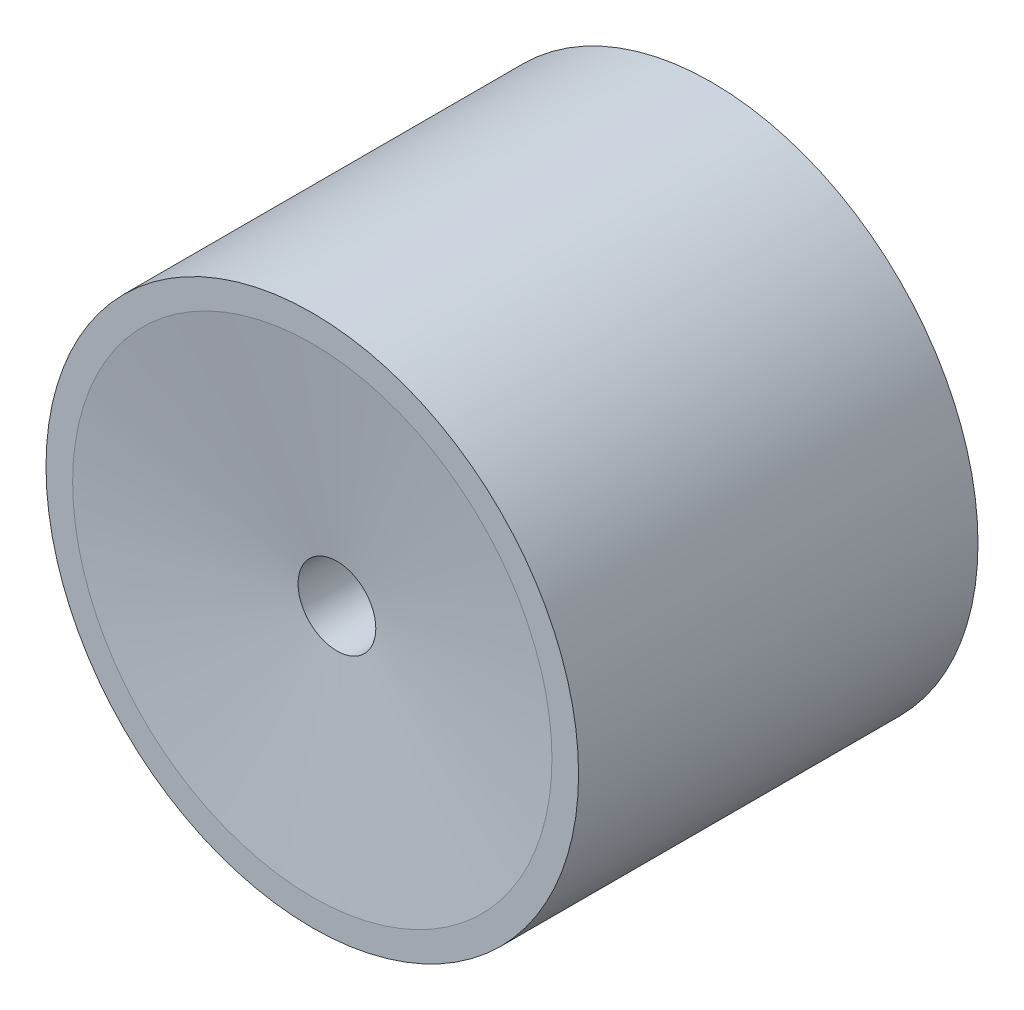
ISO-10303-21;
HEADER;
FILE_DESCRIPTION(('STEP AP214'),'2;1');
FILE_NAME('part.step','',(''),(''),'','','');
FILE_SCHEMA(('AUTOMOTIVE_DESIGN { 1 0 10303 214 1 1 1 1 }'));
ENDSEC;
DATA;
#1=APPLICATION_CONTEXT('core data for automotive mechanical design processes');
#2=APPLICATION_PROTOCOL_DEFINITION('international standard','automotive_design',2000,#1);
#3=PRODUCT_CONTEXT('',#1,'mechanical');
#4=PRODUCT('Part','Part','',(#3));
#5=PRODUCT_RELATED_PRODUCT_CATEGORY('part','',(#4));
#6=PRODUCT_DEFINITION_FORMATION('','',#4);
#7=PRODUCT_DEFINITION_CONTEXT('part definition',#1,'design');
#8=PRODUCT_DEFINITION('design','',#6,#7);
#9=PRODUCT_DEFINITION_SHAPE('','',#8);
#10=(LENGTH_UNIT() NAMED_UNIT(*) SI_UNIT(.MILLI.,.METRE.));
#11=(NAMED_UNIT(*) PLANE_ANGLE_UNIT() SI_UNIT($,.RADIAN.));
#12=(NAMED_UNIT(*) SI_UNIT($,.STERADIAN.) SOLID_ANGLE_UNIT());
#13=UNCERTAINTY_MEASURE_WITH_UNIT(LENGTH_MEASURE(1.E-05),#10,'distance_accuracy_value','');
#14=(GEOMETRIC_REPRESENTATION_CONTEXT(3) GLOBAL_UNCERTAINTY_ASSIGNED_CONTEXT((#13)) GLOBAL_UNIT_ASSIGNED_CONTEXT((#10,
#11,#12)) REPRESENTATION_CONTEXT('',''));
#15=CARTESIAN_POINT('',(0.,0.,0.));
#16=DIRECTION('',(0.,0.,1.));
#17=DIRECTION('',(1.,0.,0.));
#18=AXIS2_PLACEMENT_3D('',#15,#16,#17);
#19=CARTESIAN_POINT('',(0.,0.,0.));
#20=DIRECTION('',(0.,0.,1.));
#21=DIRECTION('',(1.,0.,0.));
#22=AXIS2_PLACEMENT_3D('',#19,#20,#21);
#23=PLANE('',#22);
#24=CARTESIAN_POINT('',(0.,0.,0.));
#25=DIRECTION('',(0.,0.,1.));
#26=DIRECTION('',(1.,0.,0.));
#27=AXIS2_PLACEMENT_3D('',#24,#25,#26);
#28=CIRCLE('',#27,3.4);
#29=CARTESIAN_POINT('',(3.4,0.,0.));
#30=VERTEX_POINT('',#29);
#31=EDGE_CURVE('E46',#30,#30,#28,.T.);
#32=ORIENTED_EDGE('',*,*,#31,.T.);
#33=EDGE_LOOP('',(#32));
#34=FACE_BOUND('',#33,.T.);
#35=CARTESIAN_POINT('',(0.,0.,0.));
#36=DIRECTION('',(0.,0.,-1.));
#37=DIRECTION('',(-1.,0.,0.));
#38=AXIS2_PLACEMENT_3D('',#35,#36,#37);
#39=CIRCLE('',#38,5.5);
#40=CARTESIAN_POINT('',(-5.5,0.,0.));
#41=VERTEX_POINT('',#40);
#42=EDGE_CURVE('E64',#41,#41,#39,.T.);
#43=ORIENTED_EDGE('',*,*,#42,.T.);
#44=EDGE_LOOP('',(#43));
#45=FACE_BOUND('',#44,.T.);
#46=ADVANCED_FACE('F31',(#34,#45),#23,.F.);
#47=CARTESIAN_POINT('',(0.,0.,0.));
#48=DIRECTION('',(0.,0.,-1.));
#49=DIRECTION('',(-1.,0.,0.));
#50=AXIS2_PLACEMENT_3D('',#47,#48,#49);
#51=CIRCLE('',#50,9.);
#52=CARTESIAN_POINT('',(-9.,0.,0.));
#53=VERTEX_POINT('',#52);
#54=EDGE_CURVE('E58',#53,#53,#51,.T.);
#55=ORIENTED_EDGE('',*,*,#54,.F.);
#56=EDGE_LOOP('',(#55));
#57=FACE_BOUND('',#56,.T.);
#58=CARTESIAN_POINT('',(0.,0.,0.));
#59=DIRECTION('',(0.,0.,1.));
#60=DIRECTION('',(1.,0.,0.));
#61=AXIS2_PLACEMENT_3D('',#58,#59,#60);
#62=CIRCLE('',#61,10.);
#63=CARTESIAN_POINT('',(10.,0.,0.));
#64=VERTEX_POINT('',#63);
#65=EDGE_CURVE('E39',#64,#64,#62,.T.);
#66=ORIENTED_EDGE('',*,*,#65,.F.);
#67=EDGE_LOOP('',(#66));
#68=FACE_BOUND('',#67,.T.);
#69=ADVANCED_FACE('F86',(#57,#68),#23,.F.);
#70=CARTESIAN_POINT('',(0.,0.,15.));
#71=DIRECTION('',(0.,0.,-1.));
#72=DIRECTION('',(-1.,0.,0.));
#73=AXIS2_PLACEMENT_3D('',#70,#71,#72);
#74=CYLINDRICAL_SURFACE('',#73,10.);
#75=CARTESIAN_POINT('',(0.,0.,15.));
#76=DIRECTION('',(0.,0.,1.));
#77=DIRECTION('',(1.,0.,0.));
#78=AXIS2_PLACEMENT_3D('',#75,#76,#77);
#79=CIRCLE('',#78,10.);
#80=CARTESIAN_POINT('',(10.,0.,15.));
#81=VERTEX_POINT('',#80);
#82=EDGE_CURVE('E10',#81,#81,#79,.T.);
#83=ORIENTED_EDGE('',*,*,#82,.F.);
#84=EDGE_LOOP('',(#83));
#85=FACE_BOUND('',#84,.T.);
#86=ORIENTED_EDGE('',*,*,#65,.T.);
#87=EDGE_LOOP('',(#86));
#88=FACE_BOUND('',#87,.T.);
#89=ADVANCED_FACE('F33',(#85,#88),#74,.T.);
#90=CARTESIAN_POINT('',(0.,0.,15.));
#91=DIRECTION('',(0.,0.,1.));
#92=DIRECTION('',(1.,0.,0.));
#93=AXIS2_PLACEMENT_3D('',#90,#91,#92);
#94=PLANE('',#93);
#95=CARTESIAN_POINT('',(0.,0.,15.));
#96=DIRECTION('',(0.,0.,1.));
#97=DIRECTION('',(1.,0.,0.));
#98=AXIS2_PLACEMENT_3D('',#95,#96,#97);
#99=CIRCLE('',#98,9.);
#100=CARTESIAN_POINT('',(8.99999999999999,0.,15.));
#101=VERTEX_POINT('',#100);
#102=EDGE_CURVE('E54',#101,#101,#99,.T.);
#103=ORIENTED_EDGE('',*,*,#102,.F.);
#104=EDGE_LOOP('',(#103));
#105=FACE_BOUND('',#104,.T.);
#106=ORIENTED_EDGE('',*,*,#82,.T.);
#107=EDGE_LOOP('',(#106));
#108=FACE_BOUND('',#107,.T.);
#109=ADVANCED_FACE('F92',(#105,#108),#94,.T.);
#110=CARTESIAN_POINT('',(0.,0.,8.));
#111=DIRECTION('',(0.,0.,-1.));
#112=DIRECTION('',(-1.,0.,0.));
#113=AXIS2_PLACEMENT_3D('',#110,#111,#112);
#114=CYLINDRICAL_SURFACE('',#113,3.4);
#115=CARTESIAN_POINT('',(0.,0.,8.));
#116=DIRECTION('',(0.,0.,1.));
#117=DIRECTION('',(1.,0.,0.));
#118=AXIS2_PLACEMENT_3D('',#115,#116,#117);
#119=CIRCLE('',#118,3.4);
#120=CARTESIAN_POINT('',(3.4,0.,8.));
#121=VERTEX_POINT('',#120);
#122=EDGE_CURVE('E44',#121,#121,#119,.T.);
#123=ORIENTED_EDGE('',*,*,#122,.T.);
#124=EDGE_LOOP('',(#123));
#125=FACE_BOUND('',#124,.T.);
#126=ORIENTED_EDGE('',*,*,#31,.F.);
#127=EDGE_LOOP('',(#126));
#128=FACE_BOUND('',#127,.T.);
#129=ADVANCED_FACE('F97',(#125,#128),#114,.F.);
#130=CARTESIAN_POINT('',(0.,0.,8.));
#131=DIRECTION('',(0.,0.,1.));
#132=DIRECTION('',(1.,0.,0.));
#133=AXIS2_PLACEMENT_3D('',#130,#131,#132);
#134=PLANE('',#133);
#135=CARTESIAN_POINT('',(0.,0.,8.));
#136=DIRECTION('',(0.,0.,-1.));
#137=DIRECTION('',(-1.,0.,0.));
#138=AXIS2_PLACEMENT_3D('',#135,#136,#137);
#139=CIRCLE('',#138,1.2);
#140=CARTESIAN_POINT('',(-1.2,0.,8.));
#141=VERTEX_POINT('',#140);
#142=EDGE_CURVE('E49',#141,#141,#139,.T.);
#143=ORIENTED_EDGE('',*,*,#142,.F.);
#144=EDGE_LOOP('',(#143));
#145=FACE_BOUND('',#144,.T.);
#146=ORIENTED_EDGE('',*,*,#122,.F.);
#147=EDGE_LOOP('',(#146));
#148=FACE_BOUND('',#147,.T.);
#149=ADVANCED_FACE('F108',(#145,#148),#134,.F.);
#150=CARTESIAN_POINT('',(0.,0.,8.));
#151=DIRECTION('',(0.,0.,1.));
#152=DIRECTION('',(-1.,0.,0.));
#153=AXIS2_PLACEMENT_3D('',#150,#151,#152);
#154=CONICAL_SURFACE('',#153,1.2,0.0427605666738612);
#155=CARTESIAN_POINT('',(0.,0.,14.0741914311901));
#156=DIRECTION('',(0.,0.,1.));
#157=DIRECTION('',(1.,0.,0.));
#158=AXIS2_PLACEMENT_3D('',#155,#156,#157);
#159=CIRCLE('',#158,1.45989428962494);
#160=CARTESIAN_POINT('',(1.45989428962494,0.,14.0741914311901));
#161=VERTEX_POINT('',#160);
#162=EDGE_CURVE('E35',#161,#161,#159,.T.);
#163=ORIENTED_EDGE('',*,*,#162,.T.);
#164=EDGE_LOOP('',(#163));
#165=FACE_BOUND('',#164,.T.);
#166=ORIENTED_EDGE('',*,*,#142,.T.);
#167=EDGE_LOOP('',(#166));
#168=FACE_BOUND('',#167,.T.);
#169=ADVANCED_FACE('F112',(#165,#168),#154,.F.);
#170=CARTESIAN_POINT('',(0.,0.,15.));
#171=DIRECTION('',(0.,0.,1.));
#172=DIRECTION('',(1.,0.,0.));
#173=AXIS2_PLACEMENT_3D('',#170,#171,#172);
#174=CONICAL_SURFACE('',#173,9.,1.4486232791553);
#175=CARTESIAN_POINT('',(8.99999999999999,0.,15.));
#176=CARTESIAN_POINT('',(8.92145723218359,0.,14.9903561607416));
#177=CARTESIAN_POINT('',(8.84291446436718,0.,14.9807123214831));
#178=CARTESIAN_POINT('',(8.68582892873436,0.,14.9614246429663));
#179=CARTESIAN_POINT('',(8.60728616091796,0.,14.9517808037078));
#180=CARTESIAN_POINT('',(8.45020062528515,0.,14.9324931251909));
#181=CARTESIAN_POINT('',(8.37165785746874,0.,14.9228492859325));
#182=CARTESIAN_POINT('',(8.21457232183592,0.,14.9035616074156));
#183=CARTESIAN_POINT('',(8.13602955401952,0.,14.8939177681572));
#184=CARTESIAN_POINT('',(7.9789440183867,0.,14.8746300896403));
#185=CARTESIAN_POINT('',(7.9004012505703,0.,14.8649862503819));
#186=CARTESIAN_POINT('',(7.74331571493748,0.,14.845698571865));
#187=CARTESIAN_POINT('',(7.66477294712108,0.,14.8360547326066));
#188=CARTESIAN_POINT('',(7.50768741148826,0.,14.8167670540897));
#189=CARTESIAN_POINT('',(7.42914464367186,0.,14.8071232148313));
#190=CARTESIAN_POINT('',(7.27205910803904,0.,14.7878355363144));
#191=CARTESIAN_POINT('',(7.19351634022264,0.,14.778191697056));
#192=CARTESIAN_POINT('',(7.03643080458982,0.,14.7589040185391));
#193=CARTESIAN_POINT('',(6.95788803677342,0.,14.7492601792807));
#194=CARTESIAN_POINT('',(6.8008025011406,0.,14.7299725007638));
#195=CARTESIAN_POINT('',(6.7222597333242,0.,14.7203286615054));
#196=CARTESIAN_POINT('',(6.56517419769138,0.,14.7010409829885));
#197=CARTESIAN_POINT('',(6.48663142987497,0.,14.69139714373));
#198=CARTESIAN_POINT('',(6.32954589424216,0.,14.6721094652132));
#199=CARTESIAN_POINT('',(6.25100312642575,0.,14.6624656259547));
#200=CARTESIAN_POINT('',(6.09391759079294,0.,14.6431779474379));
#201=CARTESIAN_POINT('',(6.01537482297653,0.,14.6335341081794));
#202=CARTESIAN_POINT('',(5.85828928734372,0.,14.6142464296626));
#203=CARTESIAN_POINT('',(5.77974651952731,0.,14.6046025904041));
#204=CARTESIAN_POINT('',(5.6226609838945,0.,14.5853149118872));
#205=CARTESIAN_POINT('',(5.54411821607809,0.,14.5756710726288));
#206=CARTESIAN_POINT('',(5.38703268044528,0.,14.5563833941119));
#207=CARTESIAN_POINT('',(5.30848991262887,0.,14.5467395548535));
#208=CARTESIAN_POINT('',(5.15140437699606,0.,14.5274518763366));
#209=CARTESIAN_POINT('',(5.07286160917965,0.,14.5178080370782));
#210=CARTESIAN_POINT('',(4.91577607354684,0.,14.4985203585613));
#211=CARTESIAN_POINT('',(4.83723330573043,0.,14.4888765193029));
#212=CARTESIAN_POINT('',(4.68014777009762,0.,14.469588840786));
#213=CARTESIAN_POINT('',(4.60160500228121,0.,14.4599450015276));
#214=CARTESIAN_POINT('',(4.4445194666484,0.,14.4406573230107));
#215=CARTESIAN_POINT('',(4.36597669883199,0.,14.4310134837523));
#216=CARTESIAN_POINT('',(4.20889116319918,0.,14.4117258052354));
#217=CARTESIAN_POINT('',(4.13034839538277,0.,14.402081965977));
#218=CARTESIAN_POINT('',(3.97326285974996,0.,14.3827942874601));
#219=CARTESIAN_POINT('',(3.89472009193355,0.,14.3731504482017));
#220=CARTESIAN_POINT('',(3.73763455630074,0.,14.3538627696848));
#221=CARTESIAN_POINT('',(3.65909178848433,0.,14.3442189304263));
#222=CARTESIAN_POINT('',(3.50200625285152,0.,14.3249312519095));
#223=CARTESIAN_POINT('',(3.42346348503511,0.,14.315287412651));
#224=CARTESIAN_POINT('',(3.2663779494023,0.,14.2959997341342));
#225=CARTESIAN_POINT('',(3.18783518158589,0.,14.2863558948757));
#226=CARTESIAN_POINT('',(3.03074964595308,0.,14.2670682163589));
#227=CARTESIAN_POINT('',(2.95220687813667,0.,14.2574243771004));
#228=CARTESIAN_POINT('',(2.79512134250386,0.,14.2381366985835));
#229=CARTESIAN_POINT('',(2.71657857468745,0.,14.2284928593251));
#230=CARTESIAN_POINT('',(2.55949303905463,0.,14.2092051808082));
#231=CARTESIAN_POINT('',(2.48095027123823,0.,14.1995613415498));
#232=CARTESIAN_POINT('',(2.32386473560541,0.,14.1802736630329));
#233=CARTESIAN_POINT('',(2.24532196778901,0.,14.1706298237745));
#234=CARTESIAN_POINT('',(2.08823643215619,0.,14.1513421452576));
#235=CARTESIAN_POINT('',(2.00969366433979,0.,14.1416983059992));
#236=CARTESIAN_POINT('',(1.85260812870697,0.,14.1224106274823));
#237=CARTESIAN_POINT('',(1.77406536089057,0.,14.1127667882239));
#238=CARTESIAN_POINT('',(1.61697982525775,0.,14.093479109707));
#239=CARTESIAN_POINT('',(1.53843705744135,0.,14.0838352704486));
#240=CARTESIAN_POINT('',(1.45989428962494,0.,14.0741914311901));
#241=B_SPLINE_CURVE_WITH_KNOTS('',3,(#175,#176,#177,#178,#179,#180,#181,#182,#183,#184,#185,
#186,#187,#188,#189,#190,#191,#192,#193,#194,#195,#196,#197,#198,#199,#200,#201,#202,#203,#204,
#205,#206,#207,#208,#209,#210,#211,#212,#213,#214,#215,#216,#217,#218,#219,#220,#221,#222,#223,
#224,#225,#226,#227,#228,#229,#230,#231,#232,#233,#234,#235,#236,#237,#238,#239,#240),
.UNSPECIFIED.,.F.,.F.,(4,2,2,2,2,2,2,2,2,2,2,2,2,2,2,2,2,2,2,2,2,2,2,2,2,2,2,2,2,2,2,2,4),(0.,
0.237397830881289,0.474795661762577,0.712193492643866,0.949591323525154,1.18698915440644,
1.42438698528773,1.66178481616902,1.89918264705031,2.1365804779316,2.37397830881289,
2.61137613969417,2.84877397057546,3.08617180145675,3.32356963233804,3.56096746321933,
3.79836529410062,4.03576312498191,4.27316095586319,4.51055878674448,4.74795661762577,
4.98535444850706,5.22275227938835,5.46015011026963,5.69754794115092,5.93494577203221,
6.1723436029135,6.40974143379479,6.64713926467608,6.88453709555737,7.12193492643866,
7.35933275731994,7.59673058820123),.UNSPECIFIED.);
#242=EDGE_CURVE('BSEAM82',#101,#161,#241,.T.);
#243=ORIENTED_EDGE('',*,*,#102,.T.);
#244=ORIENTED_EDGE('',*,*,#162,.F.);
#245=ORIENTED_EDGE('',*,*,#242,.T.);
#246=ORIENTED_EDGE('',*,*,#242,.F.);
#247=EDGE_LOOP('',(#243,#245,#244,#246));
#248=FACE_BOUND('',#247,.T.);
#249=ADVANCED_FACE('F82',(#248),#174,.F.);
#250=CARTESIAN_POINT('',(0.,0.,13.));
#251=DIRECTION('',(0.,0.,-1.));
#252=DIRECTION('',(-1.,0.,0.));
#253=AXIS2_PLACEMENT_3D('',#250,#251,#252);
#254=CYLINDRICAL_SURFACE('',#253,9.);
#255=CARTESIAN_POINT('',(0.,0.,13.));
#256=DIRECTION('',(0.,0.,-1.));
#257=DIRECTION('',(-1.,0.,0.));
#258=AXIS2_PLACEMENT_3D('',#255,#256,#257);
#259=CIRCLE('',#258,9.);
#260=CARTESIAN_POINT('',(-9.,0.,13.));
#261=VERTEX_POINT('',#260);
#262=EDGE_CURVE('E57',#261,#261,#259,.T.);
#263=CARTESIAN_POINT('',(-9.,0.,13.));
#264=CARTESIAN_POINT('',(-9.,0.,12.8645833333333));
#265=CARTESIAN_POINT('',(-9.,0.,12.7291666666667));
#266=CARTESIAN_POINT('',(-9.,0.,12.4583333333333));
#267=CARTESIAN_POINT('',(-9.,0.,12.3229166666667));
#268=CARTESIAN_POINT('',(-9.,0.,12.0520833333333));
#269=CARTESIAN_POINT('',(-9.,0.,11.9166666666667));
#270=CARTESIAN_POINT('',(-9.,0.,11.6458333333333));
#271=CARTESIAN_POINT('',(-9.,0.,11.5104166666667));
#272=CARTESIAN_POINT('',(-9.,0.,11.2395833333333));
#273=CARTESIAN_POINT('',(-9.,0.,11.1041666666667));
#274=CARTESIAN_POINT('',(-9.,0.,10.8333333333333));
#275=CARTESIAN_POINT('',(-9.,0.,10.6979166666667));
#276=CARTESIAN_POINT('',(-9.,0.,10.4270833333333));
#277=CARTESIAN_POINT('',(-9.,0.,10.2916666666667));
#278=CARTESIAN_POINT('',(-9.,0.,10.0208333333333));
#279=CARTESIAN_POINT('',(-9.,0.,9.88541666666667));
#280=CARTESIAN_POINT('',(-9.,0.,9.61458333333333));
#281=CARTESIAN_POINT('',(-9.,0.,9.47916666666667));
#282=CARTESIAN_POINT('',(-9.,0.,9.20833333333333));
#283=CARTESIAN_POINT('',(-9.,0.,9.07291666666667));
#284=CARTESIAN_POINT('',(-9.,0.,8.80208333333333));
#285=CARTESIAN_POINT('',(-9.,0.,8.66666666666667));
#286=CARTESIAN_POINT('',(-9.,0.,8.39583333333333));
#287=CARTESIAN_POINT('',(-9.,0.,8.26041666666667));
#288=CARTESIAN_POINT('',(-9.,0.,7.98958333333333));
#289=CARTESIAN_POINT('',(-9.,0.,7.85416666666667));
#290=CARTESIAN_POINT('',(-9.,0.,7.58333333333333));
#291=CARTESIAN_POINT('',(-9.,0.,7.44791666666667));
#292=CARTESIAN_POINT('',(-9.,0.,7.17708333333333));
#293=CARTESIAN_POINT('',(-9.,0.,7.04166666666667));
#294=CARTESIAN_POINT('',(-9.,0.,6.77083333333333));
#295=CARTESIAN_POINT('',(-9.,0.,6.63541666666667));
#296=CARTESIAN_POINT('',(-9.,0.,6.36458333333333));
#297=CARTESIAN_POINT('',(-9.,0.,6.22916666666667));
#298=CARTESIAN_POINT('',(-9.,0.,5.95833333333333));
#299=CARTESIAN_POINT('',(-9.,0.,5.82291666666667));
#300=CARTESIAN_POINT('',(-9.,0.,5.55208333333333));
#301=CARTESIAN_POINT('',(-9.,0.,5.41666666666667));
#302=CARTESIAN_POINT('',(-9.,0.,5.14583333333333));
#303=CARTESIAN_POINT('',(-9.,0.,5.01041666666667));
#304=CARTESIAN_POINT('',(-9.,0.,4.73958333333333));
#305=CARTESIAN_POINT('',(-9.,0.,4.60416666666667));
#306=CARTESIAN_POINT('',(-9.,0.,4.33333333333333));
#307=CARTESIAN_POINT('',(-9.,0.,4.19791666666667));
#308=CARTESIAN_POINT('',(-9.,0.,3.92708333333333));
#309=CARTESIAN_POINT('',(-9.,0.,3.79166666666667));
#310=CARTESIAN_POINT('',(-9.,0.,3.52083333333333));
#311=CARTESIAN_POINT('',(-9.,0.,3.38541666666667));
#312=CARTESIAN_POINT('',(-9.,0.,3.11458333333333));
#313=CARTESIAN_POINT('',(-9.,0.,2.97916666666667));
#314=CARTESIAN_POINT('',(-9.,0.,2.70833333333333));
#315=CARTESIAN_POINT('',(-9.,0.,2.57291666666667));
#316=CARTESIAN_POINT('',(-9.,0.,2.30208333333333));
#317=CARTESIAN_POINT('',(-9.,0.,2.16666666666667));
#318=CARTESIAN_POINT('',(-9.,0.,1.89583333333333));
#319=CARTESIAN_POINT('',(-9.,0.,1.76041666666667));
#320=CARTESIAN_POINT('',(-9.,0.,1.48958333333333));
#321=CARTESIAN_POINT('',(-9.,0.,1.35416666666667));
#322=CARTESIAN_POINT('',(-9.,0.,1.08333333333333));
#323=CARTESIAN_POINT('',(-9.,0.,0.947916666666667));
#324=CARTESIAN_POINT('',(-9.,0.,0.677083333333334));
#325=CARTESIAN_POINT('',(-9.,0.,0.541666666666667));
#326=CARTESIAN_POINT('',(-9.,0.,0.270833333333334));
#327=CARTESIAN_POINT('',(-9.,0.,0.135416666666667));
#328=CARTESIAN_POINT('',(-9.,0.,0.));
#329=B_SPLINE_CURVE_WITH_KNOTS('',3,(#263,#264,#265,#266,#267,#268,#269,#270,#271,#272,#273,
#274,#275,#276,#277,#278,#279,#280,#281,#282,#283,#284,#285,#286,#287,#288,#289,#290,#291,#292,
#293,#294,#295,#296,#297,#298,#299,#300,#301,#302,#303,#304,#305,#306,#307,#308,#309,#310,#311,
#312,#313,#314,#315,#316,#317,#318,#319,#320,#321,#322,#323,#324,#325,#326,#327,#328),
.UNSPECIFIED.,.F.,.F.,(4,2,2,2,2,2,2,2,2,2,2,2,2,2,2,2,2,2,2,2,2,2,2,2,2,2,2,2,2,2,2,2,4),(0.,
0.406249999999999,0.812499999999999,1.21875,1.625,2.03125,2.4375,2.84375,3.25,3.65625,4.0625,
4.46875,4.875,5.28125,5.6875,6.09375,6.5,6.90625,7.3125,7.71875,8.125,8.53125,8.9375,9.34375,
9.75,10.15625,10.5625,10.96875,11.375,11.78125,12.1875,12.59375,13.),.UNSPECIFIED.);
#330=EDGE_CURVE('BSEAM76',#261,#53,#329,.T.);
#331=ORIENTED_EDGE('',*,*,#262,.F.);
#332=ORIENTED_EDGE('',*,*,#54,.T.);
#333=ORIENTED_EDGE('',*,*,#330,.T.);
#334=ORIENTED_EDGE('',*,*,#330,.F.);
#335=EDGE_LOOP('',(#331,#333,#332,#334));
#336=FACE_BOUND('',#335,.T.);
#337=ADVANCED_FACE('F76',(#336),#254,.F.);
#338=CARTESIAN_POINT('',(0.,0.,13.));
#339=DIRECTION('',(0.,0.,-1.));
#340=DIRECTION('',(-1.,0.,0.));
#341=AXIS2_PLACEMENT_3D('',#338,#339,#340);
#342=PLANE('',#341);
#343=CARTESIAN_POINT('',(0.,0.,13.));
#344=DIRECTION('',(0.,0.,-1.));
#345=DIRECTION('',(-1.,0.,0.));
#346=AXIS2_PLACEMENT_3D('',#343,#344,#345);
#347=CIRCLE('',#346,5.5);
#348=CARTESIAN_POINT('',(-5.5,0.,13.));
#349=VERTEX_POINT('',#348);
#350=EDGE_CURVE('E61',#349,#349,#347,.T.);
#351=ORIENTED_EDGE('',*,*,#350,.F.);
#352=EDGE_LOOP('',(#351));
#353=FACE_BOUND('',#352,.T.);
#354=ORIENTED_EDGE('',*,*,#262,.T.);
#355=EDGE_LOOP('',(#354));
#356=FACE_BOUND('',#355,.T.);
#357=ADVANCED_FACE('F73',(#353,#356),#342,.T.);
#358=CARTESIAN_POINT('',(0.,0.,13.));
#359=DIRECTION('',(0.,0.,-1.));
#360=DIRECTION('',(-1.,0.,0.));
#361=AXIS2_PLACEMENT_3D('',#358,#359,#360);
#362=CYLINDRICAL_SURFACE('',#361,5.5);
#363=CARTESIAN_POINT('',(-5.5,0.,13.));
#364=CARTESIAN_POINT('',(-5.5,0.,12.8645833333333));
#365=CARTESIAN_POINT('',(-5.5,0.,12.7291666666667));
#366=CARTESIAN_POINT('',(-5.5,0.,12.4583333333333));
#367=CARTESIAN_POINT('',(-5.5,0.,12.3229166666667));
#368=CARTESIAN_POINT('',(-5.5,0.,12.0520833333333));
#369=CARTESIAN_POINT('',(-5.5,0.,11.9166666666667));
#370=CARTESIAN_POINT('',(-5.5,0.,11.6458333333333));
#371=CARTESIAN_POINT('',(-5.5,0.,11.5104166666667));
#372=CARTESIAN_POINT('',(-5.5,0.,11.2395833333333));
#373=CARTESIAN_POINT('',(-5.5,0.,11.1041666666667));
#374=CARTESIAN_POINT('',(-5.5,0.,10.8333333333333));
#375=CARTESIAN_POINT('',(-5.5,0.,10.6979166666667));
#376=CARTESIAN_POINT('',(-5.5,0.,10.4270833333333));
#377=CARTESIAN_POINT('',(-5.5,0.,10.2916666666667));
#378=CARTESIAN_POINT('',(-5.5,0.,10.0208333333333));
#379=CARTESIAN_POINT('',(-5.5,0.,9.88541666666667));
#380=CARTESIAN_POINT('',(-5.5,0.,9.61458333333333));
#381=CARTESIAN_POINT('',(-5.5,0.,9.47916666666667));
#382=CARTESIAN_POINT('',(-5.5,0.,9.20833333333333));
#383=CARTESIAN_POINT('',(-5.5,0.,9.07291666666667));
#384=CARTESIAN_POINT('',(-5.5,0.,8.80208333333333));
#385=CARTESIAN_POINT('',(-5.5,0.,8.66666666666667));
#386=CARTESIAN_POINT('',(-5.5,0.,8.39583333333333));
#387=CARTESIAN_POINT('',(-5.5,0.,8.26041666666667));
#388=CARTESIAN_POINT('',(-5.5,0.,7.98958333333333));
#389=CARTESIAN_POINT('',(-5.5,0.,7.85416666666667));
#390=CARTESIAN_POINT('',(-5.5,0.,7.58333333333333));
#391=CARTESIAN_POINT('',(-5.5,0.,7.44791666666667));
#392=CARTESIAN_POINT('',(-5.5,0.,7.17708333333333));
#393=CARTESIAN_POINT('',(-5.5,0.,7.04166666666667));
#394=CARTESIAN_POINT('',(-5.5,0.,6.77083333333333));
#395=CARTESIAN_POINT('',(-5.5,0.,6.63541666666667));
#396=CARTESIAN_POINT('',(-5.5,0.,6.36458333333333));
#397=CARTESIAN_POINT('',(-5.5,0.,6.22916666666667));
#398=CARTESIAN_POINT('',(-5.5,0.,5.95833333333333));
#399=CARTESIAN_POINT('',(-5.5,0.,5.82291666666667));
#400=CARTESIAN_POINT('',(-5.5,0.,5.55208333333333));
#401=CARTESIAN_POINT('',(-5.5,0.,5.41666666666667));
#402=CARTESIAN_POINT('',(-5.5,0.,5.14583333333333));
#403=CARTESIAN_POINT('',(-5.5,0.,5.01041666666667));
#404=CARTESIAN_POINT('',(-5.5,0.,4.73958333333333));
#405=CARTESIAN_POINT('',(-5.5,0.,4.60416666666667));
#406=CARTESIAN_POINT('',(-5.5,0.,4.33333333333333));
#407=CARTESIAN_POINT('',(-5.5,0.,4.19791666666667));
#408=CARTESIAN_POINT('',(-5.5,0.,3.92708333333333));
#409=CARTESIAN_POINT('',(-5.5,0.,3.79166666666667));
#410=CARTESIAN_POINT('',(-5.5,0.,3.52083333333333));
#411=CARTESIAN_POINT('',(-5.5,0.,3.38541666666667));
#412=CARTESIAN_POINT('',(-5.5,0.,3.11458333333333));
#413=CARTESIAN_POINT('',(-5.5,0.,2.97916666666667));
#414=CARTESIAN_POINT('',(-5.5,0.,2.70833333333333));
#415=CARTESIAN_POINT('',(-5.5,0.,2.57291666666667));
#416=CARTESIAN_POINT('',(-5.5,0.,2.30208333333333));
#417=CARTESIAN_POINT('',(-5.5,0.,2.16666666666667));
#418=CARTESIAN_POINT('',(-5.5,0.,1.89583333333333));
#419=CARTESIAN_POINT('',(-5.5,0.,1.76041666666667));
#420=CARTESIAN_POINT('',(-5.5,0.,1.48958333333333));
#421=CARTESIAN_POINT('',(-5.5,0.,1.35416666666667));
#422=CARTESIAN_POINT('',(-5.5,0.,1.08333333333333));
#423=CARTESIAN_POINT('',(-5.5,0.,0.947916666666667));
#424=CARTESIAN_POINT('',(-5.5,0.,0.677083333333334));
#425=CARTESIAN_POINT('',(-5.5,0.,0.541666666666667));
#426=CARTESIAN_POINT('',(-5.5,0.,0.270833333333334));
#427=CARTESIAN_POINT('',(-5.5,0.,0.135416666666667));
#428=CARTESIAN_POINT('',(-5.5,0.,0.));
#429=B_SPLINE_CURVE_WITH_KNOTS('',3,(#363,#364,#365,#366,#367,#368,#369,#370,#371,#372,#373,
#374,#375,#376,#377,#378,#379,#380,#381,#382,#383,#384,#385,#386,#387,#388,#389,#390,#391,#392,
#393,#394,#395,#396,#397,#398,#399,#400,#401,#402,#403,#404,#405,#406,#407,#408,#409,#410,#411,
#412,#413,#414,#415,#416,#417,#418,#419,#420,#421,#422,#423,#424,#425,#426,#427,#428),
.UNSPECIFIED.,.F.,.F.,(4,2,2,2,2,2,2,2,2,2,2,2,2,2,2,2,2,2,2,2,2,2,2,2,2,2,2,2,2,2,2,2,4),(0.,
0.40625,0.812500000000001,1.21875,1.625,2.03125,2.4375,2.84375,3.25,3.65625,4.0625,4.46875,
4.875,5.28125,5.6875,6.09375,6.5,6.90625,7.3125,7.71875,8.125,8.53125,8.9375,9.34375,9.75,
10.15625,10.5625,10.96875,11.375,11.78125,12.1875,12.59375,13.),.UNSPECIFIED.);
#430=EDGE_CURVE('BSEAM70',#349,#41,#429,.T.);
#431=ORIENTED_EDGE('',*,*,#350,.T.);
#432=ORIENTED_EDGE('',*,*,#42,.F.);
#433=ORIENTED_EDGE('',*,*,#430,.T.);
#434=ORIENTED_EDGE('',*,*,#430,.F.);
#435=EDGE_LOOP('',(#431,#433,#432,#434));
#436=FACE_BOUND('',#435,.T.);
#437=ADVANCED_FACE('F70',(#436),#362,.T.);
#438=CLOSED_SHELL('',(#46,#69,#89,#109,#129,#149,#169,#249,#337,#357,#437));
#439=MANIFOLD_SOLID_BREP('B2',#438);
#440=ADVANCED_BREP_SHAPE_REPRESENTATION('',(#18,#439),#14);
#441=SHAPE_DEFINITION_REPRESENTATION(#9,#440);
ENDSEC;
END-ISO-10303-21;
